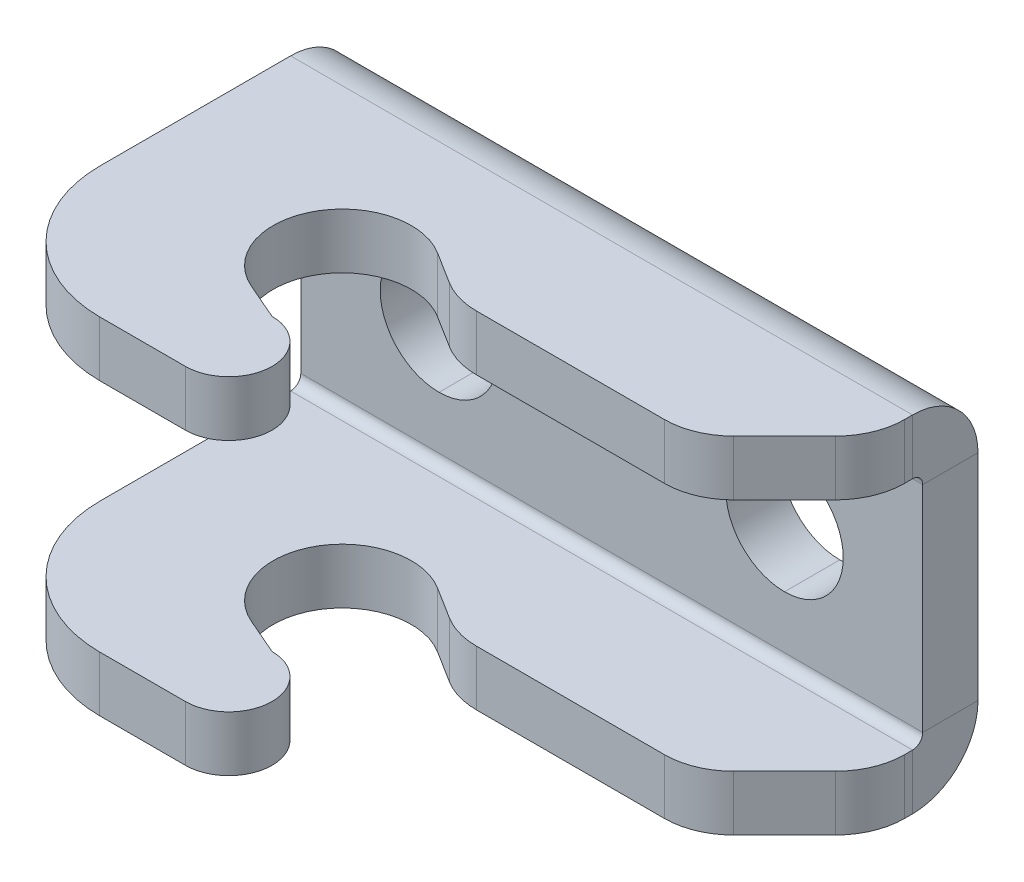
ISO-10303-21;
HEADER;
FILE_DESCRIPTION(('STEP AP214'),'2;1');
FILE_NAME('part.step','',(''),(''),'','','');
FILE_SCHEMA(('AUTOMOTIVE_DESIGN { 1 0 10303 214 1 1 1 1 }'));
ENDSEC;
DATA;
#1=APPLICATION_CONTEXT('core data for automotive mechanical design processes');
#2=APPLICATION_PROTOCOL_DEFINITION('international standard','automotive_design',2000,#1);
#3=PRODUCT_CONTEXT('',#1,'mechanical');
#4=PRODUCT('Part','Part','',(#3));
#5=PRODUCT_RELATED_PRODUCT_CATEGORY('part','',(#4));
#6=PRODUCT_DEFINITION_FORMATION('','',#4);
#7=PRODUCT_DEFINITION_CONTEXT('part definition',#1,'design');
#8=PRODUCT_DEFINITION('design','',#6,#7);
#9=PRODUCT_DEFINITION_SHAPE('','',#8);
#10=(LENGTH_UNIT() NAMED_UNIT(*) SI_UNIT(.MILLI.,.METRE.));
#11=(NAMED_UNIT(*) PLANE_ANGLE_UNIT() SI_UNIT($,.RADIAN.));
#12=(NAMED_UNIT(*) SI_UNIT($,.STERADIAN.) SOLID_ANGLE_UNIT());
#13=UNCERTAINTY_MEASURE_WITH_UNIT(LENGTH_MEASURE(1.E-05),#10,'distance_accuracy_value','');
#14=(GEOMETRIC_REPRESENTATION_CONTEXT(3) GLOBAL_UNCERTAINTY_ASSIGNED_CONTEXT((#13)) GLOBAL_UNIT_ASSIGNED_CONTEXT((#10,
#11,#12)) REPRESENTATION_CONTEXT('',''));
#15=CARTESIAN_POINT('',(0.,0.,0.));
#16=DIRECTION('',(0.,0.,1.));
#17=DIRECTION('',(1.,0.,0.));
#18=AXIS2_PLACEMENT_3D('',#15,#16,#17);
#19=CARTESIAN_POINT('',(25.,0.,0.));
#20=DIRECTION('',(0.,0.,1.));
#21=DIRECTION('',(0.,1.,0.));
#22=AXIS2_PLACEMENT_3D('',#19,#20,#21);
#23=CYLINDRICAL_SURFACE('',#22,4.25);
#24=CARTESIAN_POINT('',(25.,0.,0.));
#25=DIRECTION('',(0.,0.,1.));
#26=DIRECTION('',(0.,1.,0.));
#27=AXIS2_PLACEMENT_3D('',#24,#25,#26);
#28=CIRCLE('',#27,4.25);
#29=CARTESIAN_POINT('',(25.,-4.25,0.));
#30=VERTEX_POINT('',#29);
#31=CARTESIAN_POINT('',(25.,4.24999999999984,0.));
#32=VERTEX_POINT('',#31);
#33=EDGE_CURVE('E38',#30,#32,#28,.T.);
#34=ORIENTED_EDGE('',*,*,#33,.F.);
#35=DIRECTION('',(0.,0.,1.));
#36=VECTOR('',#35,1.);
#37=CARTESIAN_POINT('',(25.,-4.25,0.));
#38=LINE('',#37,#36);
#39=CARTESIAN_POINT('',(25.,-4.25,4.));
#40=VERTEX_POINT('',#39);
#41=EDGE_CURVE('E9',#30,#40,#38,.T.);
#42=ORIENTED_EDGE('',*,*,#41,.T.);
#43=CARTESIAN_POINT('',(25.,0.,4.));
#44=DIRECTION('',(0.,0.,1.));
#45=DIRECTION('',(0.,1.,0.));
#46=AXIS2_PLACEMENT_3D('',#43,#44,#45);
#47=CIRCLE('',#46,4.25);
#48=CARTESIAN_POINT('',(25.,4.24999999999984,4.));
#49=VERTEX_POINT('',#48);
#50=EDGE_CURVE('E24',#40,#49,#47,.T.);
#51=ORIENTED_EDGE('',*,*,#50,.T.);
#52=DIRECTION('',(0.,0.,1.));
#53=VECTOR('',#52,1.);
#54=CARTESIAN_POINT('',(25.,4.24999999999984,0.));
#55=LINE('',#54,#53);
#56=EDGE_CURVE('E560',#32,#49,#55,.T.);
#57=ORIENTED_EDGE('',*,*,#56,.F.);
#58=EDGE_LOOP('',(#34,#42,#51,#57));
#59=FACE_BOUND('',#58,.T.);
#60=ADVANCED_FACE('F14',(#59),#23,.F.);
#61=CARTESIAN_POINT('',(0.,0.,0.));
#62=DIRECTION('',(0.,0.,1.));
#63=DIRECTION('',(0.,1.,0.));
#64=AXIS2_PLACEMENT_3D('',#61,#62,#63);
#65=CYLINDRICAL_SURFACE('',#64,4.25);
#66=CARTESIAN_POINT('',(0.,0.,0.));
#67=DIRECTION('',(0.,0.,1.));
#68=DIRECTION('',(0.,1.,0.));
#69=AXIS2_PLACEMENT_3D('',#66,#67,#68);
#70=CIRCLE('',#69,4.25);
#71=CARTESIAN_POINT('',(0.,-4.25,0.));
#72=VERTEX_POINT('',#71);
#73=CARTESIAN_POINT('',(0.,4.24999999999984,0.));
#74=VERTEX_POINT('',#73);
#75=EDGE_CURVE('E366',#72,#74,#70,.T.);
#76=ORIENTED_EDGE('',*,*,#75,.F.);
#77=DIRECTION('',(0.,0.,1.));
#78=VECTOR('',#77,1.);
#79=CARTESIAN_POINT('',(0.,-4.25,0.));
#80=LINE('',#79,#78);
#81=CARTESIAN_POINT('',(0.,-4.25,4.));
#82=VERTEX_POINT('',#81);
#83=EDGE_CURVE('E569',#72,#82,#80,.T.);
#84=ORIENTED_EDGE('',*,*,#83,.T.);
#85=CARTESIAN_POINT('',(0.,0.,4.));
#86=DIRECTION('',(0.,0.,1.));
#87=DIRECTION('',(0.,1.,0.));
#88=AXIS2_PLACEMENT_3D('',#85,#86,#87);
#89=CIRCLE('',#88,4.25);
#90=CARTESIAN_POINT('',(0.,4.24999999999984,4.));
#91=VERTEX_POINT('',#90);
#92=EDGE_CURVE('E447',#82,#91,#89,.T.);
#93=ORIENTED_EDGE('',*,*,#92,.T.);
#94=DIRECTION('',(0.,0.,1.));
#95=VECTOR('',#94,1.);
#96=CARTESIAN_POINT('',(0.,4.24999999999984,0.));
#97=LINE('',#96,#95);
#98=EDGE_CURVE('E471',#74,#91,#97,.T.);
#99=ORIENTED_EDGE('',*,*,#98,.F.);
#100=EDGE_LOOP('',(#76,#84,#93,#99));
#101=FACE_BOUND('',#100,.T.);
#102=ADVANCED_FACE('F1313',(#101),#65,.F.);
#103=CARTESIAN_POINT('',(-10.,-8.80000000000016,18.5003547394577));
#104=DIRECTION('',(1.,0.,0.));
#105=DIRECTION('',(0.,-1.,0.));
#106=AXIS2_PLACEMENT_3D('',#103,#104,#105);
#107=PLANE('',#106);
#108=DIRECTION('',(0.,-1.,0.));
#109=VECTOR('',#108,1.);
#110=CARTESIAN_POINT('',(-10.,-8.80000000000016,4.7366));
#111=LINE('',#110,#109);
#112=CARTESIAN_POINT('',(-10.,-8.80000000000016,4.7366));
#113=VERTEX_POINT('',#112);
#114=CARTESIAN_POINT('',(-10.,-12.8000000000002,4.7366));
#115=VERTEX_POINT('',#114);
#116=EDGE_CURVE('E443',#113,#115,#111,.T.);
#117=ORIENTED_EDGE('',*,*,#116,.T.);
#118=DIRECTION('',(0.,0.,1.));
#119=VECTOR('',#118,1.);
#120=CARTESIAN_POINT('',(-10.,-12.8000000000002,18.5003547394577));
#121=LINE('',#120,#119);
#122=CARTESIAN_POINT('',(-10.,-12.8000000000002,18.5003547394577));
#123=VERTEX_POINT('',#122);
#124=EDGE_CURVE('E448',#115,#123,#121,.T.);
#125=ORIENTED_EDGE('',*,*,#124,.T.);
#126=DIRECTION('',(0.,-1.,0.));
#127=VECTOR('',#126,1.);
#128=CARTESIAN_POINT('',(-10.,-8.80000000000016,18.5003547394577));
#129=LINE('',#128,#127);
#130=CARTESIAN_POINT('',(-10.,-8.80000000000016,18.5003547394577));
#131=VERTEX_POINT('',#130);
#132=EDGE_CURVE('E337',#131,#123,#129,.T.);
#133=ORIENTED_EDGE('',*,*,#132,.F.);
#134=DIRECTION('',(0.,0.,1.));
#135=VECTOR('',#134,1.);
#136=CARTESIAN_POINT('',(-10.,-8.80000000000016,18.5003547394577));
#137=LINE('',#136,#135);
#138=EDGE_CURVE('E449',#113,#131,#137,.T.);
#139=ORIENTED_EDGE('',*,*,#138,.F.);
#140=EDGE_LOOP('',(#117,#125,#133,#139));
#141=FACE_BOUND('',#140,.T.);
#142=ADVANCED_FACE('F832',(#141),#107,.F.);
#143=CARTESIAN_POINT('',(35.,-8.80000000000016,5.31796021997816));
#144=DIRECTION('',(-1.,0.,0.));
#145=DIRECTION('',(0.,1.,0.));
#146=AXIS2_PLACEMENT_3D('',#143,#144,#145);
#147=PLANE('',#146);
#148=DIRECTION('',(0.,-1.,0.));
#149=VECTOR('',#148,1.);
#150=CARTESIAN_POINT('',(35.,-8.80000000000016,4.7366));
#151=LINE('',#150,#149);
#152=CARTESIAN_POINT('',(35.,-8.80000000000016,4.7366));
#153=VERTEX_POINT('',#152);
#154=CARTESIAN_POINT('',(35.,-12.8000000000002,4.7366));
#155=VERTEX_POINT('',#154);
#156=EDGE_CURVE('E512',#153,#155,#151,.T.);
#157=ORIENTED_EDGE('',*,*,#156,.F.);
#158=DIRECTION('',(0.,0.,-1.));
#159=VECTOR('',#158,1.);
#160=CARTESIAN_POINT('',(35.,-8.80000000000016,5.31796021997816));
#161=LINE('',#160,#159);
#162=CARTESIAN_POINT('',(35.,-8.80000000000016,5.31796021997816));
#163=VERTEX_POINT('',#162);
#164=EDGE_CURVE('E453',#163,#153,#161,.T.);
#165=ORIENTED_EDGE('',*,*,#164,.F.);
#166=DIRECTION('',(0.,-1.,0.));
#167=VECTOR('',#166,1.);
#168=CARTESIAN_POINT('',(35.,-8.80000000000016,5.31796021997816));
#169=LINE('',#168,#167);
#170=CARTESIAN_POINT('',(35.,-12.8000000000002,5.31796021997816));
#171=VERTEX_POINT('',#170);
#172=EDGE_CURVE('E461',#163,#171,#169,.T.);
#173=ORIENTED_EDGE('',*,*,#172,.T.);
#174=DIRECTION('',(0.,0.,-1.));
#175=VECTOR('',#174,1.);
#176=CARTESIAN_POINT('',(35.,-12.8000000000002,5.31796021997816));
#177=LINE('',#176,#175);
#178=EDGE_CURVE('E634',#171,#155,#177,.T.);
#179=ORIENTED_EDGE('',*,*,#178,.T.);
#180=EDGE_LOOP('',(#157,#165,#173,#179));
#181=FACE_BOUND('',#180,.T.);
#182=ADVANCED_FACE('F794',(#181),#147,.F.);
#183=CARTESIAN_POINT('',(30.,-8.80000000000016,5.31796021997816));
#184=DIRECTION('',(0.,1.,0.));
#185=DIRECTION('',(-1.,0.,0.));
#186=AXIS2_PLACEMENT_3D('',#183,#184,#185);
#187=PLANE('',#186);
#188=ORIENTED_EDGE('',*,*,#164,.T.);
#189=DIRECTION('',(1.,0.,0.));
#190=VECTOR('',#189,1.);
#191=CARTESIAN_POINT('',(-10.,-8.80000000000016,4.7366));
#192=LINE('',#191,#190);
#193=EDGE_CURVE('E556',#113,#153,#192,.T.);
#194=ORIENTED_EDGE('',*,*,#193,.F.);
#195=ORIENTED_EDGE('',*,*,#138,.T.);
#196=CARTESIAN_POINT('',(-0.500000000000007,-8.80000000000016,18.5003547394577));
#197=DIRECTION('',(0.,1.,0.));
#198=DIRECTION('',(0.,0.,-1.));
#199=AXIS2_PLACEMENT_3D('',#196,#197,#198);
#200=CIRCLE('',#199,9.5);
#201=CARTESIAN_POINT('',(-0.582097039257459,-8.80000000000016,28.));
#202=VERTEX_POINT('',#201);
#203=EDGE_CURVE('E431',#131,#202,#200,.T.);
#204=ORIENTED_EDGE('',*,*,#203,.T.);
#205=DIRECTION('',(1.,0.,0.));
#206=VECTOR('',#205,1.);
#207=CARTESIAN_POINT('',(5.65426838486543,-8.80000000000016,28.));
#208=LINE('',#207,#206);
#209=CARTESIAN_POINT('',(5.65426838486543,-8.80000000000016,28.));
#210=VERTEX_POINT('',#209);
#211=EDGE_CURVE('E427',#202,#210,#208,.T.);
#212=ORIENTED_EDGE('',*,*,#211,.T.);
#213=CARTESIAN_POINT('',(5.65426838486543,-8.80000000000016,24.8666125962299));
#214=DIRECTION('',(0.,1.,0.));
#215=DIRECTION('',(0.,0.,-1.));
#216=AXIS2_PLACEMENT_3D('',#213,#214,#215);
#217=CIRCLE('',#216,3.1333874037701);
#218=CARTESIAN_POINT('',(5.65426838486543,-8.80000000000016,21.7332251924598));
#219=VERTEX_POINT('',#218);
#220=EDGE_CURVE('E432',#210,#219,#217,.T.);
#221=ORIENTED_EDGE('',*,*,#220,.T.);
#222=DIRECTION('',(-0.91749887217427,0.,-0.397738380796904));
#223=VECTOR('',#222,1.);
#224=CARTESIAN_POINT('',(5.65426838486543,-8.80000000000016,21.7332251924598));
#225=LINE('',#224,#223);
#226=CARTESIAN_POINT('',(3.01130809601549,-8.80000000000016,20.5874943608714));
#227=VERTEX_POINT('',#226);
#228=EDGE_CURVE('E392',#219,#227,#225,.T.);
#229=ORIENTED_EDGE('',*,*,#228,.T.);
#230=CARTESIAN_POINT('',(5.,-8.80000000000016,16.));
#231=DIRECTION('',(0.,-1.,0.));
#232=DIRECTION('',(0.,0.,-1.));
#233=AXIS2_PLACEMENT_3D('',#230,#231,#232);
#234=CIRCLE('',#233,5.);
#235=CARTESIAN_POINT('',(7.65685980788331,-8.80000000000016,11.7643069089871));
#236=VERTEX_POINT('',#235);
#237=EDGE_CURVE('E388',#227,#236,#234,.T.);
#238=ORIENTED_EDGE('',*,*,#237,.T.);
#239=DIRECTION('',(0.847138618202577,0.,0.531371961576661));
#240=VECTOR('',#239,1.);
#241=CARTESIAN_POINT('',(7.65685980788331,-8.80000000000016,11.7643069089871));
#242=LINE('',#241,#240);
#243=CARTESIAN_POINT('',(9.96454832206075,-8.80000000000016,13.2118161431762));
#244=VERTEX_POINT('',#243);
#245=EDGE_CURVE('E393',#236,#244,#242,.T.);
#246=ORIENTED_EDGE('',*,*,#245,.T.);
#247=CARTESIAN_POINT('',(12.7044084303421,-8.80000000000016,8.84380000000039));
#248=DIRECTION('',(0.,1.,0.));
#249=DIRECTION('',(0.,0.,-1.));
#250=AXIS2_PLACEMENT_3D('',#247,#248,#249);
#251=CIRCLE('',#250,5.15619999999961);
#252=CARTESIAN_POINT('',(12.7044084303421,-8.80000000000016,14.));
#253=VERTEX_POINT('',#252);
#254=EDGE_CURVE('E484',#244,#253,#251,.T.);
#255=ORIENTED_EDGE('',*,*,#254,.T.);
#256=DIRECTION('',(1.,0.,0.));
#257=VECTOR('',#256,1.);
#258=CARTESIAN_POINT('',(12.7044084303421,-8.80000000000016,14.));
#259=LINE('',#258,#257);
#260=CARTESIAN_POINT('',(26.3179602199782,-8.80000000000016,14.));
#261=VERTEX_POINT('',#260);
#262=EDGE_CURVE('E638',#253,#261,#259,.T.);
#263=ORIENTED_EDGE('',*,*,#262,.T.);
#264=CARTESIAN_POINT('',(26.3179602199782,-8.80000000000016,9.));
#265=DIRECTION('',(0.,1.,0.));
#266=DIRECTION('',(0.,0.,-1.));
#267=AXIS2_PLACEMENT_3D('',#264,#265,#266);
#268=CIRCLE('',#267,5.);
#269=CARTESIAN_POINT('',(29.8534941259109,-8.80000000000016,12.5355339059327));
#270=VERTEX_POINT('',#269);
#271=EDGE_CURVE('E642',#261,#270,#268,.T.);
#272=ORIENTED_EDGE('',*,*,#271,.T.);
#273=DIRECTION('',(0.707106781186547,0.,-0.707106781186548));
#274=VECTOR('',#273,1.);
#275=CARTESIAN_POINT('',(33.5355339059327,-8.80000000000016,8.85349412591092));
#276=LINE('',#275,#274);
#277=CARTESIAN_POINT('',(33.5355339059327,-8.80000000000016,8.85349412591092));
#278=VERTEX_POINT('',#277);
#279=EDGE_CURVE('E537',#270,#278,#276,.T.);
#280=ORIENTED_EDGE('',*,*,#279,.T.);
#281=CARTESIAN_POINT('',(30.,-8.80000000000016,5.31796021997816));
#282=DIRECTION('',(0.,1.,0.));
#283=DIRECTION('',(0.,0.,-1.));
#284=AXIS2_PLACEMENT_3D('',#281,#282,#283);
#285=CIRCLE('',#284,5.);
#286=EDGE_CURVE('E436',#278,#163,#285,.T.);
#287=ORIENTED_EDGE('',*,*,#286,.T.);
#288=EDGE_LOOP('',(#188,#194,#195,#204,#212,#221,#229,#238,#246,#255,#263,#272,#280,#287));
#289=FACE_BOUND('',#288,.T.);
#290=ADVANCED_FACE('F797',(#289),#187,.T.);
#291=CARTESIAN_POINT('',(30.,-12.8000000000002,5.31796021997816));
#292=DIRECTION('',(0.,1.,0.));
#293=DIRECTION('',(-1.,0.,0.));
#294=AXIS2_PLACEMENT_3D('',#291,#292,#293);
#295=PLANE('',#294);
#296=DIRECTION('',(1.,0.,0.));
#297=VECTOR('',#296,1.);
#298=CARTESIAN_POINT('',(-10.,-12.8000000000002,4.7366));
#299=LINE('',#298,#297);
#300=EDGE_CURVE('E336',#115,#155,#299,.T.);
#301=ORIENTED_EDGE('',*,*,#300,.T.);
#302=ORIENTED_EDGE('',*,*,#178,.F.);
#303=CARTESIAN_POINT('',(30.,-12.8000000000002,5.31796021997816));
#304=DIRECTION('',(0.,1.,0.));
#305=DIRECTION('',(0.,0.,-1.));
#306=AXIS2_PLACEMENT_3D('',#303,#304,#305);
#307=CIRCLE('',#306,5.);
#308=CARTESIAN_POINT('',(33.5355339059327,-12.8000000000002,8.85349412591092));
#309=VERTEX_POINT('',#308);
#310=EDGE_CURVE('E359',#309,#171,#307,.T.);
#311=ORIENTED_EDGE('',*,*,#310,.F.);
#312=DIRECTION('',(0.707106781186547,0.,-0.707106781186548));
#313=VECTOR('',#312,1.);
#314=CARTESIAN_POINT('',(33.5355339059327,-12.8000000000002,8.85349412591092));
#315=LINE('',#314,#313);
#316=CARTESIAN_POINT('',(29.8534941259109,-12.8000000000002,12.5355339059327));
#317=VERTEX_POINT('',#316);
#318=EDGE_CURVE('E358',#317,#309,#315,.T.);
#319=ORIENTED_EDGE('',*,*,#318,.F.);
#320=CARTESIAN_POINT('',(26.3179602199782,-12.8000000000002,9.));
#321=DIRECTION('',(0.,1.,0.));
#322=DIRECTION('',(0.,0.,-1.));
#323=AXIS2_PLACEMENT_3D('',#320,#321,#322);
#324=CIRCLE('',#323,5.);
#325=CARTESIAN_POINT('',(26.3179602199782,-12.8000000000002,14.));
#326=VERTEX_POINT('',#325);
#327=EDGE_CURVE('E408',#326,#317,#324,.T.);
#328=ORIENTED_EDGE('',*,*,#327,.F.);
#329=DIRECTION('',(1.,0.,0.));
#330=VECTOR('',#329,1.);
#331=CARTESIAN_POINT('',(12.7044084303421,-12.8000000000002,14.));
#332=LINE('',#331,#330);
#333=CARTESIAN_POINT('',(12.7044084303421,-12.8000000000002,14.));
#334=VERTEX_POINT('',#333);
#335=EDGE_CURVE('E495',#334,#326,#332,.T.);
#336=ORIENTED_EDGE('',*,*,#335,.F.);
#337=CARTESIAN_POINT('',(12.7044084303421,-12.8000000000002,8.84380000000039));
#338=DIRECTION('',(0.,1.,0.));
#339=DIRECTION('',(0.,0.,-1.));
#340=AXIS2_PLACEMENT_3D('',#337,#338,#339);
#341=CIRCLE('',#340,5.15619999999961);
#342=CARTESIAN_POINT('',(9.96454832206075,-12.8000000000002,13.2118161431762));
#343=VERTEX_POINT('',#342);
#344=EDGE_CURVE('E349',#343,#334,#341,.T.);
#345=ORIENTED_EDGE('',*,*,#344,.F.);
#346=DIRECTION('',(0.847138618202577,0.,0.531371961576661));
#347=VECTOR('',#346,1.);
#348=CARTESIAN_POINT('',(7.65685980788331,-12.8000000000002,11.7643069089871));
#349=LINE('',#348,#347);
#350=CARTESIAN_POINT('',(7.65685980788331,-12.8000000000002,11.7643069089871));
#351=VERTEX_POINT('',#350);
#352=EDGE_CURVE('E348',#351,#343,#349,.T.);
#353=ORIENTED_EDGE('',*,*,#352,.F.);
#354=CARTESIAN_POINT('',(5.,-12.8000000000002,16.));
#355=DIRECTION('',(0.,-1.,0.));
#356=DIRECTION('',(0.,0.,-1.));
#357=AXIS2_PLACEMENT_3D('',#354,#355,#356);
#358=CIRCLE('',#357,5.);
#359=CARTESIAN_POINT('',(3.01130809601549,-12.8000000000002,20.5874943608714));
#360=VERTEX_POINT('',#359);
#361=EDGE_CURVE('E376',#360,#351,#358,.T.);
#362=ORIENTED_EDGE('',*,*,#361,.F.);
#363=DIRECTION('',(-0.91749887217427,0.,-0.397738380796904));
#364=VECTOR('',#363,1.);
#365=CARTESIAN_POINT('',(5.65426838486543,-12.8000000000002,21.7332251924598));
#366=LINE('',#365,#364);
#367=CARTESIAN_POINT('',(5.65426838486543,-12.8000000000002,21.7332251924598));
#368=VERTEX_POINT('',#367);
#369=EDGE_CURVE('E521',#368,#360,#366,.T.);
#370=ORIENTED_EDGE('',*,*,#369,.F.);
#371=CARTESIAN_POINT('',(5.65426838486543,-12.8000000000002,24.8666125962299));
#372=DIRECTION('',(0.,1.,0.));
#373=DIRECTION('',(0.,0.,-1.));
#374=AXIS2_PLACEMENT_3D('',#371,#372,#373);
#375=CIRCLE('',#374,3.1333874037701);
#376=CARTESIAN_POINT('',(5.65426838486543,-12.8000000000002,28.));
#377=VERTEX_POINT('',#376);
#378=EDGE_CURVE('E317',#377,#368,#375,.T.);
#379=ORIENTED_EDGE('',*,*,#378,.F.);
#380=DIRECTION('',(1.,0.,0.));
#381=VECTOR('',#380,1.);
#382=CARTESIAN_POINT('',(5.65426838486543,-12.8000000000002,28.));
#383=LINE('',#382,#381);
#384=CARTESIAN_POINT('',(-0.582097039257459,-12.8000000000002,28.));
#385=VERTEX_POINT('',#384);
#386=EDGE_CURVE('E400',#385,#377,#383,.T.);
#387=ORIENTED_EDGE('',*,*,#386,.F.);
#388=CARTESIAN_POINT('',(-0.500000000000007,-12.8000000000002,18.5003547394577));
#389=DIRECTION('',(0.,1.,0.));
#390=DIRECTION('',(0.,0.,-1.));
#391=AXIS2_PLACEMENT_3D('',#388,#389,#390);
#392=CIRCLE('',#391,9.5);
#393=EDGE_CURVE('E332',#123,#385,#392,.T.);
#394=ORIENTED_EDGE('',*,*,#393,.F.);
#395=ORIENTED_EDGE('',*,*,#124,.F.);
#396=EDGE_LOOP('',(#301,#302,#311,#319,#328,#336,#345,#353,#362,#370,#379,#387,#394,#395));
#397=FACE_BOUND('',#396,.T.);
#398=ADVANCED_FACE('F713',(#397),#295,.F.);
#399=CARTESIAN_POINT('',(-0.500000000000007,-8.80000000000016,18.5003547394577));
#400=DIRECTION('',(0.,-1.,0.));
#401=DIRECTION('',(0.,0.,1.));
#402=AXIS2_PLACEMENT_3D('',#399,#400,#401);
#403=CYLINDRICAL_SURFACE('',#402,9.5);
#404=ORIENTED_EDGE('',*,*,#393,.T.);
#405=DIRECTION('',(0.,-1.,0.));
#406=VECTOR('',#405,1.);
#407=CARTESIAN_POINT('',(-0.582097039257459,-8.80000000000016,28.));
#408=LINE('',#407,#406);
#409=EDGE_CURVE('E320',#202,#385,#408,.T.);
#410=ORIENTED_EDGE('',*,*,#409,.F.);
#411=ORIENTED_EDGE('',*,*,#203,.F.);
#412=ORIENTED_EDGE('',*,*,#132,.T.);
#413=EDGE_LOOP('',(#404,#410,#411,#412));
#414=FACE_BOUND('',#413,.T.);
#415=ADVANCED_FACE('F836',(#414),#403,.T.);
#416=CARTESIAN_POINT('',(5.65426838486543,-8.80000000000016,28.));
#417=DIRECTION('',(0.,0.,-1.));
#418=DIRECTION('',(0.,-1.,0.));
#419=AXIS2_PLACEMENT_3D('',#416,#417,#418);
#420=PLANE('',#419);
#421=ORIENTED_EDGE('',*,*,#386,.T.);
#422=DIRECTION('',(0.,-1.,0.));
#423=VECTOR('',#422,1.);
#424=CARTESIAN_POINT('',(5.65426838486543,-8.80000000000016,28.));
#425=LINE('',#424,#423);
#426=EDGE_CURVE('E321',#210,#377,#425,.T.);
#427=ORIENTED_EDGE('',*,*,#426,.F.);
#428=ORIENTED_EDGE('',*,*,#211,.F.);
#429=ORIENTED_EDGE('',*,*,#409,.T.);
#430=EDGE_LOOP('',(#421,#427,#428,#429));
#431=FACE_BOUND('',#430,.T.);
#432=ADVANCED_FACE('F1038',(#431),#420,.F.);
#433=CARTESIAN_POINT('',(5.65426838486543,-8.80000000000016,24.8666125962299));
#434=DIRECTION('',(0.,-1.,0.));
#435=DIRECTION('',(0.,0.,1.));
#436=AXIS2_PLACEMENT_3D('',#433,#434,#435);
#437=CYLINDRICAL_SURFACE('',#436,3.1333874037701);
#438=ORIENTED_EDGE('',*,*,#378,.T.);
#439=DIRECTION('',(0.,-1.,0.));
#440=VECTOR('',#439,1.);
#441=CARTESIAN_POINT('',(5.65426838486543,-8.80000000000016,21.7332251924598));
#442=LINE('',#441,#440);
#443=EDGE_CURVE('E525',#219,#368,#442,.T.);
#444=ORIENTED_EDGE('',*,*,#443,.F.);
#445=ORIENTED_EDGE('',*,*,#220,.F.);
#446=ORIENTED_EDGE('',*,*,#426,.T.);
#447=EDGE_LOOP('',(#438,#444,#445,#446));
#448=FACE_BOUND('',#447,.T.);
#449=ADVANCED_FACE('F1032',(#448),#437,.T.);
#450=CARTESIAN_POINT('',(5.65426838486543,-8.80000000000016,21.7332251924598));
#451=DIRECTION('',(-0.397738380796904,0.,0.91749887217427));
#452=DIRECTION('',(0.,1.,0.));
#453=AXIS2_PLACEMENT_3D('',#450,#451,#452);
#454=PLANE('',#453);
#455=ORIENTED_EDGE('',*,*,#369,.T.);
#456=DIRECTION('',(0.,-1.,0.));
#457=VECTOR('',#456,1.);
#458=CARTESIAN_POINT('',(3.01130809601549,-8.80000000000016,20.5874943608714));
#459=LINE('',#458,#457);
#460=EDGE_CURVE('E372',#227,#360,#459,.T.);
#461=ORIENTED_EDGE('',*,*,#460,.F.);
#462=ORIENTED_EDGE('',*,*,#228,.F.);
#463=ORIENTED_EDGE('',*,*,#443,.T.);
#464=EDGE_LOOP('',(#455,#461,#462,#463));
#465=FACE_BOUND('',#464,.T.);
#466=ADVANCED_FACE('F1037',(#465),#454,.F.);
#467=CARTESIAN_POINT('',(5.,-8.80000000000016,16.));
#468=DIRECTION('',(0.,-1.,0.));
#469=DIRECTION('',(0.,0.,1.));
#470=AXIS2_PLACEMENT_3D('',#467,#468,#469);
#471=CYLINDRICAL_SURFACE('',#470,5.);
#472=ORIENTED_EDGE('',*,*,#361,.T.);
#473=DIRECTION('',(0.,-1.,0.));
#474=VECTOR('',#473,1.);
#475=CARTESIAN_POINT('',(7.65685980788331,-8.80000000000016,11.7643069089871));
#476=LINE('',#475,#474);
#477=EDGE_CURVE('E344',#236,#351,#476,.T.);
#478=ORIENTED_EDGE('',*,*,#477,.F.);
#479=ORIENTED_EDGE('',*,*,#237,.F.);
#480=ORIENTED_EDGE('',*,*,#460,.T.);
#481=EDGE_LOOP('',(#472,#478,#479,#480));
#482=FACE_BOUND('',#481,.T.);
#483=ADVANCED_FACE('F1053',(#482),#471,.F.);
#484=CARTESIAN_POINT('',(7.65685980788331,-8.80000000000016,11.7643069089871));
#485=DIRECTION('',(0.531371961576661,0.,-0.847138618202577));
#486=DIRECTION('',(0.847138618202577,0.,0.531371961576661));
#487=AXIS2_PLACEMENT_3D('',#484,#485,#486);
#488=PLANE('',#487);
#489=ORIENTED_EDGE('',*,*,#352,.T.);
#490=DIRECTION('',(0.,-1.,0.));
#491=VECTOR('',#490,1.);
#492=CARTESIAN_POINT('',(9.96454832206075,-8.80000000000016,13.2118161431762));
#493=LINE('',#492,#491);
#494=EDGE_CURVE('E465',#244,#343,#493,.T.);
#495=ORIENTED_EDGE('',*,*,#494,.F.);
#496=ORIENTED_EDGE('',*,*,#245,.F.);
#497=ORIENTED_EDGE('',*,*,#477,.T.);
#498=EDGE_LOOP('',(#489,#495,#496,#497));
#499=FACE_BOUND('',#498,.T.);
#500=ADVANCED_FACE('F1047',(#499),#488,.F.);
#501=CARTESIAN_POINT('',(12.7044084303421,-8.80000000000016,8.84380000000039));
#502=DIRECTION('',(0.,-1.,0.));
#503=DIRECTION('',(0.,0.,1.));
#504=AXIS2_PLACEMENT_3D('',#501,#502,#503);
#505=CYLINDRICAL_SURFACE('',#504,5.15619999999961);
#506=ORIENTED_EDGE('',*,*,#344,.T.);
#507=DIRECTION('',(0.,-1.,0.));
#508=VECTOR('',#507,1.);
#509=CARTESIAN_POINT('',(12.7044084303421,-8.80000000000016,14.));
#510=LINE('',#509,#508);
#511=EDGE_CURVE('E520',#253,#334,#510,.T.);
#512=ORIENTED_EDGE('',*,*,#511,.F.);
#513=ORIENTED_EDGE('',*,*,#254,.F.);
#514=ORIENTED_EDGE('',*,*,#494,.T.);
#515=EDGE_LOOP('',(#506,#512,#513,#514));
#516=FACE_BOUND('',#515,.T.);
#517=ADVANCED_FACE('F1052',(#516),#505,.T.);
#518=CARTESIAN_POINT('',(12.7044084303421,-8.80000000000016,14.));
#519=DIRECTION('',(0.,0.,-1.));
#520=DIRECTION('',(0.,-1.,0.));
#521=AXIS2_PLACEMENT_3D('',#518,#519,#520);
#522=PLANE('',#521);
#523=ORIENTED_EDGE('',*,*,#335,.T.);
#524=DIRECTION('',(0.,-1.,0.));
#525=VECTOR('',#524,1.);
#526=CARTESIAN_POINT('',(26.3179602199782,-8.80000000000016,14.));
#527=LINE('',#526,#525);
#528=EDGE_CURVE('E404',#261,#326,#527,.T.);
#529=ORIENTED_EDGE('',*,*,#528,.F.);
#530=ORIENTED_EDGE('',*,*,#262,.F.);
#531=ORIENTED_EDGE('',*,*,#511,.T.);
#532=EDGE_LOOP('',(#523,#529,#530,#531));
#533=FACE_BOUND('',#532,.T.);
#534=ADVANCED_FACE('F723',(#533),#522,.F.);
#535=CARTESIAN_POINT('',(26.3179602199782,-8.80000000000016,9.));
#536=DIRECTION('',(0.,-1.,0.));
#537=DIRECTION('',(0.,0.,1.));
#538=AXIS2_PLACEMENT_3D('',#535,#536,#537);
#539=CYLINDRICAL_SURFACE('',#538,5.);
#540=ORIENTED_EDGE('',*,*,#327,.T.);
#541=DIRECTION('',(0.,-1.,0.));
#542=VECTOR('',#541,1.);
#543=CARTESIAN_POINT('',(29.8534941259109,-8.80000000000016,12.5355339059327));
#544=LINE('',#543,#542);
#545=EDGE_CURVE('E354',#270,#317,#544,.T.);
#546=ORIENTED_EDGE('',*,*,#545,.F.);
#547=ORIENTED_EDGE('',*,*,#271,.F.);
#548=ORIENTED_EDGE('',*,*,#528,.T.);
#549=EDGE_LOOP('',(#540,#546,#547,#548));
#550=FACE_BOUND('',#549,.T.);
#551=ADVANCED_FACE('F719',(#550),#539,.T.);
#552=CARTESIAN_POINT('',(33.5355339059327,-8.80000000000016,8.85349412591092));
#553=DIRECTION('',(-0.707106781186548,0.,-0.707106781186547));
#554=DIRECTION('',(0.,-1.,0.));
#555=AXIS2_PLACEMENT_3D('',#552,#553,#554);
#556=PLANE('',#555);
#557=ORIENTED_EDGE('',*,*,#318,.T.);
#558=DIRECTION('',(0.,-1.,0.));
#559=VECTOR('',#558,1.);
#560=CARTESIAN_POINT('',(33.5355339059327,-8.80000000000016,8.85349412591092));
#561=LINE('',#560,#559);
#562=EDGE_CURVE('E491',#278,#309,#561,.T.);
#563=ORIENTED_EDGE('',*,*,#562,.F.);
#564=ORIENTED_EDGE('',*,*,#279,.F.);
#565=ORIENTED_EDGE('',*,*,#545,.T.);
#566=EDGE_LOOP('',(#557,#563,#564,#565));
#567=FACE_BOUND('',#566,.T.);
#568=ADVANCED_FACE('F708',(#567),#556,.F.);
#569=CARTESIAN_POINT('',(30.,-8.80000000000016,5.31796021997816));
#570=DIRECTION('',(0.,-1.,0.));
#571=DIRECTION('',(0.,0.,1.));
#572=AXIS2_PLACEMENT_3D('',#569,#570,#571);
#573=CYLINDRICAL_SURFACE('',#572,5.);
#574=ORIENTED_EDGE('',*,*,#310,.T.);
#575=ORIENTED_EDGE('',*,*,#172,.F.);
#576=ORIENTED_EDGE('',*,*,#286,.F.);
#577=ORIENTED_EDGE('',*,*,#562,.T.);
#578=EDGE_LOOP('',(#574,#575,#576,#577));
#579=FACE_BOUND('',#578,.T.);
#580=ADVANCED_FACE('F704',(#579),#573,.T.);
#581=CARTESIAN_POINT('',(35.,-8.06340000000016,4.7366));
#582=DIRECTION('',(1.,0.,0.));
#583=DIRECTION('',(0.,0.,-1.));
#584=AXIS2_PLACEMENT_3D('',#581,#582,#583);
#585=PLANE('',#584);
#586=DIRECTION('',(0.,0.,-1.));
#587=VECTOR('',#586,1.);
#588=CARTESIAN_POINT('',(35.,-8.06340000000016,0.));
#589=LINE('',#588,#587);
#590=CARTESIAN_POINT('',(35.,-8.06340000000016,4.));
#591=VERTEX_POINT('',#590);
#592=CARTESIAN_POINT('',(35.,-8.06340000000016,0.));
#593=VERTEX_POINT('',#592);
#594=EDGE_CURVE('E508',#591,#593,#589,.T.);
#595=ORIENTED_EDGE('',*,*,#594,.F.);
#596=CARTESIAN_POINT('',(35.,-8.06340000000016,4.7366));
#597=DIRECTION('',(1.,0.,0.));
#598=DIRECTION('',(0.,0.,1.));
#599=AXIS2_PLACEMENT_3D('',#596,#597,#598);
#600=CIRCLE('',#599,0.7366);
#601=EDGE_CURVE('E578',#153,#591,#600,.T.);
#602=ORIENTED_EDGE('',*,*,#601,.F.);
#603=ORIENTED_EDGE('',*,*,#156,.T.);
#604=CARTESIAN_POINT('',(35.,-8.06340000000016,4.7366));
#605=DIRECTION('',(1.,0.,0.));
#606=DIRECTION('',(0.,0.,1.));
#607=AXIS2_PLACEMENT_3D('',#604,#605,#606);
#608=CIRCLE('',#607,4.7366);
#609=EDGE_CURVE('E398',#155,#593,#608,.T.);
#610=ORIENTED_EDGE('',*,*,#609,.T.);
#611=EDGE_LOOP('',(#595,#602,#603,#610));
#612=FACE_BOUND('',#611,.T.);
#613=ADVANCED_FACE('F798',(#612),#585,.T.);
#614=CARTESIAN_POINT('',(-10.,-8.06340000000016,4.7366));
#615=DIRECTION('',(1.,0.,0.));
#616=DIRECTION('',(0.,0.,-1.));
#617=AXIS2_PLACEMENT_3D('',#614,#615,#616);
#618=PLANE('',#617);
#619=CARTESIAN_POINT('',(-10.,-8.06340000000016,4.7366));
#620=DIRECTION('',(-1.,0.,0.));
#621=DIRECTION('',(0.,0.,1.));
#622=AXIS2_PLACEMENT_3D('',#619,#620,#621);
#623=CIRCLE('',#622,0.7366);
#624=CARTESIAN_POINT('',(-10.,-8.06340000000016,4.));
#625=VERTEX_POINT('',#624);
#626=EDGE_CURVE('E441',#625,#113,#623,.T.);
#627=ORIENTED_EDGE('',*,*,#626,.F.);
#628=DIRECTION('',(0.,0.,-1.));
#629=VECTOR('',#628,1.);
#630=CARTESIAN_POINT('',(-10.,-8.06340000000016,4.));
#631=LINE('',#630,#629);
#632=CARTESIAN_POINT('',(-10.,-8.06340000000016,0.));
#633=VERTEX_POINT('',#632);
#634=EDGE_CURVE('E394',#625,#633,#631,.T.);
#635=ORIENTED_EDGE('',*,*,#634,.T.);
#636=CARTESIAN_POINT('',(-10.,-8.06340000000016,4.7366));
#637=DIRECTION('',(-1.,0.,0.));
#638=DIRECTION('',(0.,0.,1.));
#639=AXIS2_PLACEMENT_3D('',#636,#637,#638);
#640=CIRCLE('',#639,4.7366);
#641=EDGE_CURVE('E399',#633,#115,#640,.T.);
#642=ORIENTED_EDGE('',*,*,#641,.T.);
#643=ORIENTED_EDGE('',*,*,#116,.F.);
#644=EDGE_LOOP('',(#627,#635,#642,#643));
#645=FACE_BOUND('',#644,.T.);
#646=ADVANCED_FACE('F786',(#645),#618,.F.);
#647=CARTESIAN_POINT('',(-10.,-8.06340000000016,4.7366));
#648=DIRECTION('',(-1.,0.,0.));
#649=DIRECTION('',(0.,0.,-1.));
#650=AXIS2_PLACEMENT_3D('',#647,#648,#649);
#651=CYLINDRICAL_SURFACE('',#650,4.7366);
#652=ORIENTED_EDGE('',*,*,#300,.F.);
#653=ORIENTED_EDGE('',*,*,#641,.F.);
#654=DIRECTION('',(1.,0.,0.));
#655=VECTOR('',#654,1.);
#656=CARTESIAN_POINT('',(35.,-8.06340000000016,0.));
#657=LINE('',#656,#655);
#658=EDGE_CURVE('E552',#633,#593,#657,.T.);
#659=ORIENTED_EDGE('',*,*,#658,.T.);
#660=ORIENTED_EDGE('',*,*,#609,.F.);
#661=EDGE_LOOP('',(#652,#653,#659,#660));
#662=FACE_BOUND('',#661,.T.);
#663=ADVANCED_FACE('F828',(#662),#651,.T.);
#664=CARTESIAN_POINT('',(-10.,-8.06340000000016,4.7366));
#665=DIRECTION('',(-1.,0.,0.));
#666=DIRECTION('',(0.,0.,-1.));
#667=AXIS2_PLACEMENT_3D('',#664,#665,#666);
#668=CYLINDRICAL_SURFACE('',#667,0.7366);
#669=ORIENTED_EDGE('',*,*,#193,.T.);
#670=ORIENTED_EDGE('',*,*,#601,.T.);
#671=DIRECTION('',(-1.,0.,0.));
#672=VECTOR('',#671,1.);
#673=CARTESIAN_POINT('',(35.,-8.06340000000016,4.));
#674=LINE('',#673,#672);
#675=EDGE_CURVE('E595',#591,#625,#674,.T.);
#676=ORIENTED_EDGE('',*,*,#675,.T.);
#677=ORIENTED_EDGE('',*,*,#626,.T.);
#678=EDGE_LOOP('',(#669,#670,#676,#677));
#679=FACE_BOUND('',#678,.T.);
#680=ADVANCED_FACE('F788',(#679),#668,.F.);
#681=CARTESIAN_POINT('',(-10.,-0.300000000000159,0.));
#682=DIRECTION('',(1.,0.,0.));
#683=DIRECTION('',(0.,0.,-1.));
#684=AXIS2_PLACEMENT_3D('',#681,#682,#683);
#685=PLANE('',#684);
#686=ORIENTED_EDGE('',*,*,#634,.F.);
#687=DIRECTION('',(0.,1.,0.));
#688=VECTOR('',#687,1.);
#689=CARTESIAN_POINT('',(-10.,-0.300000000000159,4.));
#690=LINE('',#689,#688);
#691=CARTESIAN_POINT('',(-10.,7.46339999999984,3.99999999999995));
#692=VERTEX_POINT('',#691);
#693=EDGE_CURVE('E437',#625,#692,#690,.T.);
#694=ORIENTED_EDGE('',*,*,#693,.T.);
#695=DIRECTION('',(0.,0.,-1.));
#696=VECTOR('',#695,1.);
#697=CARTESIAN_POINT('',(-10.,7.46339999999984,3.99999999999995));
#698=LINE('',#697,#696);
#699=CARTESIAN_POINT('',(-10.,7.46339999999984,0.));
#700=VERTEX_POINT('',#699);
#701=EDGE_CURVE('E442',#692,#700,#698,.T.);
#702=ORIENTED_EDGE('',*,*,#701,.T.);
#703=DIRECTION('',(0.,1.,0.));
#704=VECTOR('',#703,1.);
#705=CARTESIAN_POINT('',(-10.,-8.80000000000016,0.));
#706=LINE('',#705,#704);
#707=EDGE_CURVE('E422',#633,#700,#706,.T.);
#708=ORIENTED_EDGE('',*,*,#707,.F.);
#709=EDGE_LOOP('',(#686,#694,#702,#708));
#710=FACE_BOUND('',#709,.T.);
#711=ADVANCED_FACE('F809',(#710),#685,.F.);
#712=CARTESIAN_POINT('',(35.,-8.80000000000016,0.));
#713=DIRECTION('',(-1.,0.,0.));
#714=DIRECTION('',(0.,1.,0.));
#715=AXIS2_PLACEMENT_3D('',#712,#713,#714);
#716=PLANE('',#715);
#717=ORIENTED_EDGE('',*,*,#594,.T.);
#718=DIRECTION('',(0.,-1.,0.));
#719=VECTOR('',#718,1.);
#720=CARTESIAN_POINT('',(35.,-8.80000000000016,0.));
#721=LINE('',#720,#719);
#722=CARTESIAN_POINT('',(35.,7.46339999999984,0.));
#723=VERTEX_POINT('',#722);
#724=EDGE_CURVE('E338',#723,#593,#721,.T.);
#725=ORIENTED_EDGE('',*,*,#724,.F.);
#726=DIRECTION('',(0.,0.,-1.));
#727=VECTOR('',#726,1.);
#728=CARTESIAN_POINT('',(35.,7.46339999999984,0.));
#729=LINE('',#728,#727);
#730=CARTESIAN_POINT('',(35.,7.46339999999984,4.));
#731=VERTEX_POINT('',#730);
#732=EDGE_CURVE('E579',#731,#723,#729,.T.);
#733=ORIENTED_EDGE('',*,*,#732,.F.);
#734=DIRECTION('',(0.,-1.,0.));
#735=VECTOR('',#734,1.);
#736=CARTESIAN_POINT('',(35.,-8.80000000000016,4.));
#737=LINE('',#736,#735);
#738=EDGE_CURVE('E425',#731,#591,#737,.T.);
#739=ORIENTED_EDGE('',*,*,#738,.T.);
#740=EDGE_LOOP('',(#717,#725,#733,#739));
#741=FACE_BOUND('',#740,.T.);
#742=ADVANCED_FACE('F948',(#741),#716,.F.);
#743=CARTESIAN_POINT('',(-10.,-8.80000000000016,0.));
#744=DIRECTION('',(0.,0.,1.));
#745=DIRECTION('',(0.,1.,0.));
#746=AXIS2_PLACEMENT_3D('',#743,#744,#745);
#747=PLANE('',#746);
#748=ORIENTED_EDGE('',*,*,#658,.F.);
#749=ORIENTED_EDGE('',*,*,#707,.T.);
#750=DIRECTION('',(1.,0.,0.));
#751=VECTOR('',#750,1.);
#752=CARTESIAN_POINT('',(35.,7.46339999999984,0.));
#753=LINE('',#752,#751);
#754=EDGE_CURVE('E342',#700,#723,#753,.T.);
#755=ORIENTED_EDGE('',*,*,#754,.T.);
#756=ORIENTED_EDGE('',*,*,#724,.T.);
#757=EDGE_LOOP('',(#748,#749,#755,#756));
#758=FACE_BOUND('',#757,.T.);
#759=CARTESIAN_POINT('',(25.,0.,0.));
#760=DIRECTION('',(0.,0.,1.));
#761=DIRECTION('',(0.,1.,0.));
#762=AXIS2_PLACEMENT_3D('',#759,#760,#761);
#763=CIRCLE('',#762,4.25);
#764=EDGE_CURVE('E343',#32,#30,#763,.T.);
#765=ORIENTED_EDGE('',*,*,#764,.T.);
#766=ORIENTED_EDGE('',*,*,#33,.T.);
#767=EDGE_LOOP('',(#765,#766));
#768=FACE_BOUND('',#767,.T.);
#769=CARTESIAN_POINT('',(0.,0.,0.));
#770=DIRECTION('',(0.,0.,1.));
#771=DIRECTION('',(0.,1.,0.));
#772=AXIS2_PLACEMENT_3D('',#769,#770,#771);
#773=CIRCLE('',#772,4.25);
#774=EDGE_CURVE('E370',#74,#72,#773,.T.);
#775=ORIENTED_EDGE('',*,*,#774,.T.);
#776=ORIENTED_EDGE('',*,*,#75,.T.);
#777=EDGE_LOOP('',(#775,#776));
#778=FACE_BOUND('',#777,.T.);
#779=ADVANCED_FACE('F824',(#758,#768,#778),#747,.F.);
#780=CARTESIAN_POINT('',(-10.,-8.80000000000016,4.));
#781=DIRECTION('',(0.,0.,1.));
#782=DIRECTION('',(0.,1.,0.));
#783=AXIS2_PLACEMENT_3D('',#780,#781,#782);
#784=PLANE('',#783);
#785=ORIENTED_EDGE('',*,*,#693,.F.);
#786=ORIENTED_EDGE('',*,*,#675,.F.);
#787=ORIENTED_EDGE('',*,*,#738,.F.);
#788=DIRECTION('',(-1.,0.,0.));
#789=VECTOR('',#788,1.);
#790=CARTESIAN_POINT('',(35.,7.46339999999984,4.));
#791=LINE('',#790,#789);
#792=EDGE_CURVE('E371',#731,#692,#791,.T.);
#793=ORIENTED_EDGE('',*,*,#792,.T.);
#794=EDGE_LOOP('',(#785,#786,#787,#793));
#795=FACE_BOUND('',#794,.T.);
#796=CARTESIAN_POINT('',(25.,0.,4.));
#797=DIRECTION('',(0.,0.,1.));
#798=DIRECTION('',(0.,1.,0.));
#799=AXIS2_PLACEMENT_3D('',#796,#797,#798);
#800=CIRCLE('',#799,4.25);
#801=EDGE_CURVE('E17',#49,#40,#800,.T.);
#802=ORIENTED_EDGE('',*,*,#801,.F.);
#803=ORIENTED_EDGE('',*,*,#50,.F.);
#804=EDGE_LOOP('',(#802,#803));
#805=FACE_BOUND('',#804,.T.);
#806=CARTESIAN_POINT('',(0.,0.,4.));
#807=DIRECTION('',(0.,0.,1.));
#808=DIRECTION('',(0.,1.,0.));
#809=AXIS2_PLACEMENT_3D('',#806,#807,#808);
#810=CIRCLE('',#809,4.25);
#811=EDGE_CURVE('E540',#91,#82,#810,.T.);
#812=ORIENTED_EDGE('',*,*,#811,.F.);
#813=ORIENTED_EDGE('',*,*,#92,.F.);
#814=EDGE_LOOP('',(#812,#813));
#815=FACE_BOUND('',#814,.T.);
#816=ADVANCED_FACE('F802',(#795,#805,#815),#784,.T.);
#817=CARTESIAN_POINT('',(-10.,8.19999999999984,18.5003547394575));
#818=DIRECTION('',(1.,0.,0.));
#819=DIRECTION('',(0.,-1.,0.));
#820=AXIS2_PLACEMENT_3D('',#817,#818,#819);
#821=PLANE('',#820);
#822=DIRECTION('',(0.,1.,0.));
#823=VECTOR('',#822,1.);
#824=CARTESIAN_POINT('',(-10.,8.19999999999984,4.7366));
#825=LINE('',#824,#823);
#826=CARTESIAN_POINT('',(-10.,8.19999999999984,4.7366));
#827=VERTEX_POINT('',#826);
#828=CARTESIAN_POINT('',(-10.,12.1999999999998,4.73659999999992));
#829=VERTEX_POINT('',#828);
#830=EDGE_CURVE('E604',#827,#829,#825,.T.);
#831=ORIENTED_EDGE('',*,*,#830,.F.);
#832=DIRECTION('',(0.,0.,1.));
#833=VECTOR('',#832,1.);
#834=CARTESIAN_POINT('',(-10.,8.19999999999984,18.5003547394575));
#835=LINE('',#834,#833);
#836=CARTESIAN_POINT('',(-10.,8.19999999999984,18.5003547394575));
#837=VERTEX_POINT('',#836);
#838=EDGE_CURVE('E417',#827,#837,#835,.T.);
#839=ORIENTED_EDGE('',*,*,#838,.T.);
#840=DIRECTION('',(0.,1.,0.));
#841=VECTOR('',#840,1.);
#842=CARTESIAN_POINT('',(-10.,8.19999999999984,18.5003547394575));
#843=LINE('',#842,#841);
#844=CARTESIAN_POINT('',(-10.,12.1999999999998,18.5003547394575));
#845=VERTEX_POINT('',#844);
#846=EDGE_CURVE('E421',#837,#845,#843,.T.);
#847=ORIENTED_EDGE('',*,*,#846,.T.);
#848=DIRECTION('',(0.,0.,1.));
#849=VECTOR('',#848,1.);
#850=CARTESIAN_POINT('',(-10.,12.1999999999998,18.5003547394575));
#851=LINE('',#850,#849);
#852=EDGE_CURVE('E630',#829,#845,#851,.T.);
#853=ORIENTED_EDGE('',*,*,#852,.F.);
#854=EDGE_LOOP('',(#831,#839,#847,#853));
#855=FACE_BOUND('',#854,.T.);
#856=ADVANCED_FACE('F1089',(#855),#821,.F.);
#857=CARTESIAN_POINT('',(35.,8.19999999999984,5.31796021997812));
#858=DIRECTION('',(-1.,0.,0.));
#859=DIRECTION('',(0.,1.,0.));
#860=AXIS2_PLACEMENT_3D('',#857,#858,#859);
#861=PLANE('',#860);
#862=DIRECTION('',(0.,1.,0.));
#863=VECTOR('',#862,1.);
#864=CARTESIAN_POINT('',(35.,8.19999999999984,4.7366));
#865=LINE('',#864,#863);
#866=CARTESIAN_POINT('',(35.,8.19999999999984,4.7366));
#867=VERTEX_POINT('',#866);
#868=CARTESIAN_POINT('',(35.,12.1999999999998,4.73659999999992));
#869=VERTEX_POINT('',#868);
#870=EDGE_CURVE('E526',#867,#869,#865,.T.);
#871=ORIENTED_EDGE('',*,*,#870,.T.);
#872=DIRECTION('',(0.,0.,-1.));
#873=VECTOR('',#872,1.);
#874=CARTESIAN_POINT('',(35.,12.1999999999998,5.3179602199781));
#875=LINE('',#874,#873);
#876=CARTESIAN_POINT('',(35.,12.1999999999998,5.3179602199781));
#877=VERTEX_POINT('',#876);
#878=EDGE_CURVE('E377',#877,#869,#875,.T.);
#879=ORIENTED_EDGE('',*,*,#878,.F.);
#880=DIRECTION('',(0.,1.,0.));
#881=VECTOR('',#880,1.);
#882=CARTESIAN_POINT('',(35.,8.19999999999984,5.31796021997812));
#883=LINE('',#882,#881);
#884=CARTESIAN_POINT('',(35.,8.19999999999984,5.31796021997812));
#885=VERTEX_POINT('',#884);
#886=EDGE_CURVE('E414',#885,#877,#883,.T.);
#887=ORIENTED_EDGE('',*,*,#886,.F.);
#888=DIRECTION('',(0.,0.,-1.));
#889=VECTOR('',#888,1.);
#890=CARTESIAN_POINT('',(35.,8.19999999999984,5.31796021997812));
#891=LINE('',#890,#889);
#892=EDGE_CURVE('E530',#885,#867,#891,.T.);
#893=ORIENTED_EDGE('',*,*,#892,.T.);
#894=EDGE_LOOP('',(#871,#879,#887,#893));
#895=FACE_BOUND('',#894,.T.);
#896=ADVANCED_FACE('F1094',(#895),#861,.F.);
#897=CARTESIAN_POINT('',(30.,8.19999999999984,5.31796021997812));
#898=DIRECTION('',(0.,-1.,0.));
#899=DIRECTION('',(-1.,0.,0.));
#900=AXIS2_PLACEMENT_3D('',#897,#898,#899);
#901=PLANE('',#900);
#902=ORIENTED_EDGE('',*,*,#892,.F.);
#903=CARTESIAN_POINT('',(30.,8.19999999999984,5.31796021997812));
#904=DIRECTION('',(0.,1.,0.));
#905=DIRECTION('',(0.,0.,-1.));
#906=AXIS2_PLACEMENT_3D('',#903,#904,#905);
#907=CIRCLE('',#906,5.);
#908=CARTESIAN_POINT('',(33.5355339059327,8.19999999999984,8.85349412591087));
#909=VERTEX_POINT('',#908);
#910=EDGE_CURVE('E409',#909,#885,#907,.T.);
#911=ORIENTED_EDGE('',*,*,#910,.F.);
#912=DIRECTION('',(0.707106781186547,0.,-0.707106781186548));
#913=VECTOR('',#912,1.);
#914=CARTESIAN_POINT('',(33.5355339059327,8.19999999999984,8.85349412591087));
#915=LINE('',#914,#913);
#916=CARTESIAN_POINT('',(29.8534941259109,8.19999999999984,12.5355339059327));
#917=VERTEX_POINT('',#916);
#918=EDGE_CURVE('E387',#917,#909,#915,.T.);
#919=ORIENTED_EDGE('',*,*,#918,.F.);
#920=CARTESIAN_POINT('',(26.3179602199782,8.19999999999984,9.));
#921=DIRECTION('',(0.,1.,0.));
#922=DIRECTION('',(0.,0.,-1.));
#923=AXIS2_PLACEMENT_3D('',#920,#921,#922);
#924=CIRCLE('',#923,5.);
#925=CARTESIAN_POINT('',(26.3179602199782,8.19999999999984,14.));
#926=VERTEX_POINT('',#925);
#927=EDGE_CURVE('E103',#926,#917,#924,.T.);
#928=ORIENTED_EDGE('',*,*,#927,.F.);
#929=DIRECTION('',(1.,0.,0.));
#930=VECTOR('',#929,1.);
#931=CARTESIAN_POINT('',(12.7044084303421,8.19999999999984,14.));
#932=LINE('',#931,#930);
#933=CARTESIAN_POINT('',(12.7044084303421,8.19999999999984,14.));
#934=VERTEX_POINT('',#933);
#935=EDGE_CURVE('E115',#934,#926,#932,.T.);
#936=ORIENTED_EDGE('',*,*,#935,.F.);
#937=CARTESIAN_POINT('',(12.7044084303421,8.19999999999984,8.84380000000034));
#938=DIRECTION('',(0.,1.,0.));
#939=DIRECTION('',(0.,0.,-1.));
#940=AXIS2_PLACEMENT_3D('',#937,#938,#939);
#941=CIRCLE('',#940,5.15619999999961);
#942=CARTESIAN_POINT('',(9.96454832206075,8.19999999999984,13.2118161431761));
#943=VERTEX_POINT('',#942);
#944=EDGE_CURVE('E286',#943,#934,#941,.T.);
#945=ORIENTED_EDGE('',*,*,#944,.F.);
#946=DIRECTION('',(0.847138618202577,0.,0.531371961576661));
#947=VECTOR('',#946,1.);
#948=CARTESIAN_POINT('',(7.65685980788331,8.19999999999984,11.7643069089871));
#949=LINE('',#948,#947);
#950=CARTESIAN_POINT('',(7.65685980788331,8.19999999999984,11.7643069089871));
#951=VERTEX_POINT('',#950);
#952=EDGE_CURVE('E279',#951,#943,#949,.T.);
#953=ORIENTED_EDGE('',*,*,#952,.F.);
#954=CARTESIAN_POINT('',(5.,8.19999999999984,16.));
#955=DIRECTION('',(0.,-1.,0.));
#956=DIRECTION('',(0.,0.,-1.));
#957=AXIS2_PLACEMENT_3D('',#954,#955,#956);
#958=CIRCLE('',#957,5.);
#959=CARTESIAN_POINT('',(3.01130809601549,8.19999999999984,20.5874943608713));
#960=VERTEX_POINT('',#959);
#961=EDGE_CURVE('E284',#960,#951,#958,.T.);
#962=ORIENTED_EDGE('',*,*,#961,.F.);
#963=DIRECTION('',(-0.91749887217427,0.,-0.397738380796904));
#964=VECTOR('',#963,1.);
#965=CARTESIAN_POINT('',(5.65426838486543,8.19999999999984,21.7332251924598));
#966=LINE('',#965,#964);
#967=CARTESIAN_POINT('',(5.65426838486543,8.19999999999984,21.7332251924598));
#968=VERTEX_POINT('',#967);
#969=EDGE_CURVE('E350',#968,#960,#966,.T.);
#970=ORIENTED_EDGE('',*,*,#969,.F.);
#971=CARTESIAN_POINT('',(5.65426838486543,8.19999999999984,24.8666125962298));
#972=DIRECTION('',(0.,1.,0.));
#973=DIRECTION('',(0.,0.,-1.));
#974=AXIS2_PLACEMENT_3D('',#971,#972,#973);
#975=CIRCLE('',#974,3.1333874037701);
#976=CARTESIAN_POINT('',(5.65426838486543,8.19999999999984,28.));
#977=VERTEX_POINT('',#976);
#978=EDGE_CURVE('E475',#977,#968,#975,.T.);
#979=ORIENTED_EDGE('',*,*,#978,.F.);
#980=DIRECTION('',(1.,0.,0.));
#981=VECTOR('',#980,1.);
#982=CARTESIAN_POINT('',(5.65426838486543,8.19999999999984,28.));
#983=LINE('',#982,#981);
#984=CARTESIAN_POINT('',(-0.582097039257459,8.19999999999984,28.));
#985=VERTEX_POINT('',#984);
#986=EDGE_CURVE('E476',#985,#977,#983,.T.);
#987=ORIENTED_EDGE('',*,*,#986,.F.);
#988=CARTESIAN_POINT('',(-0.500000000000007,8.19999999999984,18.5003547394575));
#989=DIRECTION('',(0.,1.,0.));
#990=DIRECTION('',(0.,0.,-1.));
#991=AXIS2_PLACEMENT_3D('',#988,#989,#990);
#992=CIRCLE('',#991,9.5);
#993=EDGE_CURVE('E382',#837,#985,#992,.T.);
#994=ORIENTED_EDGE('',*,*,#993,.F.);
#995=ORIENTED_EDGE('',*,*,#838,.F.);
#996=DIRECTION('',(1.,0.,0.));
#997=VECTOR('',#996,1.);
#998=CARTESIAN_POINT('',(-10.,8.19999999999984,4.7366));
#999=LINE('',#998,#997);
#1000=EDGE_CURVE('E626',#827,#867,#999,.T.);
#1001=ORIENTED_EDGE('',*,*,#1000,.T.);
#1002=EDGE_LOOP('',(#902,#911,#919,#928,#936,#945,#953,#962,#970,#979,#987,#994,#995,#1001));
#1003=FACE_BOUND('',#1002,.T.);
#1004=ADVANCED_FACE('F282',(#1003),#901,.T.);
#1005=CARTESIAN_POINT('',(30.,12.1999999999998,5.3179602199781));
#1006=DIRECTION('',(0.,-1.,0.));
#1007=DIRECTION('',(-1.,0.,0.));
#1008=AXIS2_PLACEMENT_3D('',#1005,#1006,#1007);
#1009=PLANE('',#1008);
#1010=DIRECTION('',(1.,0.,0.));
#1011=VECTOR('',#1010,1.);
#1012=CARTESIAN_POINT('',(-10.,12.1999999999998,4.73659999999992));
#1013=LINE('',#1012,#1011);
#1014=EDGE_CURVE('E315',#829,#869,#1013,.T.);
#1015=ORIENTED_EDGE('',*,*,#1014,.F.);
#1016=ORIENTED_EDGE('',*,*,#852,.T.);
#1017=CARTESIAN_POINT('',(-0.500000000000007,12.1999999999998,18.5003547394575));
#1018=DIRECTION('',(0.,1.,0.));
#1019=DIRECTION('',(0.,0.,-1.));
#1020=AXIS2_PLACEMENT_3D('',#1017,#1018,#1019);
#1021=CIRCLE('',#1020,9.5);
#1022=CARTESIAN_POINT('',(-0.582097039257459,12.1999999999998,28.));
#1023=VERTEX_POINT('',#1022);
#1024=EDGE_CURVE('E516',#845,#1023,#1021,.T.);
#1025=ORIENTED_EDGE('',*,*,#1024,.T.);
#1026=DIRECTION('',(1.,0.,0.));
#1027=VECTOR('',#1026,1.);
#1028=CARTESIAN_POINT('',(5.65426838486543,12.1999999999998,28.));
#1029=LINE('',#1028,#1027);
#1030=CARTESIAN_POINT('',(5.65426838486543,12.1999999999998,28.));
#1031=VERTEX_POINT('',#1030);
#1032=EDGE_CURVE('E364',#1023,#1031,#1029,.T.);
#1033=ORIENTED_EDGE('',*,*,#1032,.T.);
#1034=CARTESIAN_POINT('',(5.65426838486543,12.1999999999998,24.8666125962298));
#1035=DIRECTION('',(0.,1.,0.));
#1036=DIRECTION('',(0.,0.,-1.));
#1037=AXIS2_PLACEMENT_3D('',#1034,#1035,#1036);
#1038=CIRCLE('',#1037,3.1333874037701);
#1039=CARTESIAN_POINT('',(5.65426838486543,12.1999999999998,21.7332251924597));
#1040=VERTEX_POINT('',#1039);
#1041=EDGE_CURVE('E360',#1031,#1040,#1038,.T.);
#1042=ORIENTED_EDGE('',*,*,#1041,.T.);
#1043=DIRECTION('',(-0.91749887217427,0.,-0.397738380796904));
#1044=VECTOR('',#1043,1.);
#1045=CARTESIAN_POINT('',(5.65426838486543,12.1999999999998,21.7332251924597));
#1046=LINE('',#1045,#1044);
#1047=CARTESIAN_POINT('',(3.01130809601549,12.1999999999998,20.5874943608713));
#1048=VERTEX_POINT('',#1047);
#1049=EDGE_CURVE('E365',#1040,#1048,#1046,.T.);
#1050=ORIENTED_EDGE('',*,*,#1049,.T.);
#1051=CARTESIAN_POINT('',(5.,12.1999999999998,16.));
#1052=DIRECTION('',(0.,-1.,0.));
#1053=DIRECTION('',(0.,0.,-1.));
#1054=AXIS2_PLACEMENT_3D('',#1051,#1052,#1053);
#1055=CIRCLE('',#1054,5.);
#1056=CARTESIAN_POINT('',(7.65685980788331,12.1999999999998,11.764306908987));
#1057=VERTEX_POINT('',#1056);
#1058=EDGE_CURVE('E533',#1048,#1057,#1055,.T.);
#1059=ORIENTED_EDGE('',*,*,#1058,.T.);
#1060=DIRECTION('',(0.847138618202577,0.,0.531371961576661));
#1061=VECTOR('',#1060,1.);
#1062=CARTESIAN_POINT('',(7.65685980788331,12.1999999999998,11.764306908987));
#1063=LINE('',#1062,#1061);
#1064=CARTESIAN_POINT('',(9.96454832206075,12.1999999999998,13.2118161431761));
#1065=VERTEX_POINT('',#1064);
#1066=EDGE_CURVE('E305',#1057,#1065,#1063,.T.);
#1067=ORIENTED_EDGE('',*,*,#1066,.T.);
#1068=CARTESIAN_POINT('',(12.7044084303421,12.1999999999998,8.8438000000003));
#1069=DIRECTION('',(0.,1.,0.));
#1070=DIRECTION('',(0.,0.,-1.));
#1071=AXIS2_PLACEMENT_3D('',#1068,#1069,#1070);
#1072=CIRCLE('',#1071,5.15619999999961);
#1073=CARTESIAN_POINT('',(12.7044084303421,12.1999999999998,14.));
#1074=VERTEX_POINT('',#1073);
#1075=EDGE_CURVE('E326',#1065,#1074,#1072,.T.);
#1076=ORIENTED_EDGE('',*,*,#1075,.T.);
#1077=DIRECTION('',(1.,0.,0.));
#1078=VECTOR('',#1077,1.);
#1079=CARTESIAN_POINT('',(12.7044084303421,12.1999999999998,14.));
#1080=LINE('',#1079,#1078);
#1081=CARTESIAN_POINT('',(26.3179602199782,12.1999999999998,14.));
#1082=VERTEX_POINT('',#1081);
#1083=EDGE_CURVE('E322',#1074,#1082,#1080,.T.);
#1084=ORIENTED_EDGE('',*,*,#1083,.T.);
#1085=CARTESIAN_POINT('',(26.3179602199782,12.1999999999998,9.));
#1086=DIRECTION('',(0.,1.,0.));
#1087=DIRECTION('',(0.,0.,-1.));
#1088=AXIS2_PLACEMENT_3D('',#1085,#1086,#1087);
#1089=CIRCLE('',#1088,5.);
#1090=CARTESIAN_POINT('',(29.8534941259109,12.1999999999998,12.5355339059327));
#1091=VERTEX_POINT('',#1090);
#1092=EDGE_CURVE('E327',#1082,#1091,#1089,.T.);
#1093=ORIENTED_EDGE('',*,*,#1092,.T.);
#1094=DIRECTION('',(0.707106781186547,0.,-0.707106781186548));
#1095=VECTOR('',#1094,1.);
#1096=CARTESIAN_POINT('',(33.5355339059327,12.1999999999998,8.85349412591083));
#1097=LINE('',#1096,#1095);
#1098=CARTESIAN_POINT('',(33.5355339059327,12.1999999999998,8.85349412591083));
#1099=VERTEX_POINT('',#1098);
#1100=EDGE_CURVE('E646',#1091,#1099,#1097,.T.);
#1101=ORIENTED_EDGE('',*,*,#1100,.T.);
#1102=CARTESIAN_POINT('',(30.,12.1999999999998,5.3179602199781));
#1103=DIRECTION('',(0.,1.,0.));
#1104=DIRECTION('',(0.,0.,-1.));
#1105=AXIS2_PLACEMENT_3D('',#1102,#1103,#1104);
#1106=CIRCLE('',#1105,5.);
#1107=EDGE_CURVE('E381',#1099,#877,#1106,.T.);
#1108=ORIENTED_EDGE('',*,*,#1107,.T.);
#1109=ORIENTED_EDGE('',*,*,#878,.T.);
#1110=EDGE_LOOP('',(#1015,#1016,#1025,#1033,#1042,#1050,#1059,#1067,#1076,#1084,#1093,#1101,
#1108,#1109));
#1111=FACE_BOUND('',#1110,.T.);
#1112=ADVANCED_FACE('F1111',(#1111),#1009,.F.);
#1113=CARTESIAN_POINT('',(-0.500000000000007,8.19999999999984,18.5003547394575));
#1114=DIRECTION('',(0.,1.,0.));
#1115=DIRECTION('',(0.,0.,1.));
#1116=AXIS2_PLACEMENT_3D('',#1113,#1114,#1115);
#1117=CYLINDRICAL_SURFACE('',#1116,9.5);
#1118=ORIENTED_EDGE('',*,*,#1024,.F.);
#1119=ORIENTED_EDGE('',*,*,#846,.F.);
#1120=ORIENTED_EDGE('',*,*,#993,.T.);
#1121=DIRECTION('',(0.,1.,0.));
#1122=VECTOR('',#1121,1.);
#1123=CARTESIAN_POINT('',(-0.582097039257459,8.19999999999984,28.));
#1124=LINE('',#1123,#1122);
#1125=EDGE_CURVE('E457',#985,#1023,#1124,.T.);
#1126=ORIENTED_EDGE('',*,*,#1125,.T.);
#1127=EDGE_LOOP('',(#1118,#1119,#1120,#1126));
#1128=FACE_BOUND('',#1127,.T.);
#1129=ADVANCED_FACE('F982',(#1128),#1117,.T.);
#1130=CARTESIAN_POINT('',(5.65426838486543,8.19999999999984,28.));
#1131=DIRECTION('',(0.,0.,-1.));
#1132=DIRECTION('',(0.,-1.,0.));
#1133=AXIS2_PLACEMENT_3D('',#1130,#1131,#1132);
#1134=PLANE('',#1133);
#1135=ORIENTED_EDGE('',*,*,#1032,.F.);
#1136=ORIENTED_EDGE('',*,*,#1125,.F.);
#1137=ORIENTED_EDGE('',*,*,#986,.T.);
#1138=DIRECTION('',(0.,1.,0.));
#1139=VECTOR('',#1138,1.);
#1140=CARTESIAN_POINT('',(5.65426838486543,8.19999999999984,28.));
#1141=LINE('',#1140,#1139);
#1142=EDGE_CURVE('E480',#977,#1031,#1141,.T.);
#1143=ORIENTED_EDGE('',*,*,#1142,.T.);
#1144=EDGE_LOOP('',(#1135,#1136,#1137,#1143));
#1145=FACE_BOUND('',#1144,.T.);
#1146=ADVANCED_FACE('F976',(#1145),#1134,.F.);
#1147=CARTESIAN_POINT('',(5.65426838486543,8.19999999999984,24.8666125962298));
#1148=DIRECTION('',(0.,1.,0.));
#1149=DIRECTION('',(0.,0.,1.));
#1150=AXIS2_PLACEMENT_3D('',#1147,#1148,#1149);
#1151=CYLINDRICAL_SURFACE('',#1150,3.1333874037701);
#1152=ORIENTED_EDGE('',*,*,#1041,.F.);
#1153=ORIENTED_EDGE('',*,*,#1142,.F.);
#1154=ORIENTED_EDGE('',*,*,#978,.T.);
#1155=DIRECTION('',(0.,1.,0.));
#1156=VECTOR('',#1155,1.);
#1157=CARTESIAN_POINT('',(5.65426838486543,8.19999999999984,21.7332251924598));
#1158=LINE('',#1157,#1156);
#1159=EDGE_CURVE('E353',#968,#1040,#1158,.T.);
#1160=ORIENTED_EDGE('',*,*,#1159,.T.);
#1161=EDGE_LOOP('',(#1152,#1153,#1154,#1160));
#1162=FACE_BOUND('',#1161,.T.);
#1163=ADVANCED_FACE('F981',(#1162),#1151,.T.);
#1164=CARTESIAN_POINT('',(5.65426838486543,8.19999999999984,21.7332251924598));
#1165=DIRECTION('',(-0.397738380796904,0.,0.91749887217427));
#1166=DIRECTION('',(0.,1.,0.));
#1167=AXIS2_PLACEMENT_3D('',#1164,#1165,#1166);
#1168=PLANE('',#1167);
#1169=ORIENTED_EDGE('',*,*,#1049,.F.);
#1170=ORIENTED_EDGE('',*,*,#1159,.F.);
#1171=ORIENTED_EDGE('',*,*,#969,.T.);
#1172=DIRECTION('',(0.,1.,0.));
#1173=VECTOR('',#1172,1.);
#1174=CARTESIAN_POINT('',(3.01130809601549,8.19999999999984,20.5874943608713));
#1175=LINE('',#1174,#1173);
#1176=EDGE_CURVE('E300',#960,#1048,#1175,.T.);
#1177=ORIENTED_EDGE('',*,*,#1176,.T.);
#1178=EDGE_LOOP('',(#1169,#1170,#1171,#1177));
#1179=FACE_BOUND('',#1178,.T.);
#1180=ADVANCED_FACE('F994',(#1179),#1168,.F.);
#1181=CARTESIAN_POINT('',(5.,8.19999999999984,16.));
#1182=DIRECTION('',(0.,1.,0.));
#1183=DIRECTION('',(0.,0.,1.));
#1184=AXIS2_PLACEMENT_3D('',#1181,#1182,#1183);
#1185=CYLINDRICAL_SURFACE('',#1184,5.);
#1186=ORIENTED_EDGE('',*,*,#1058,.F.);
#1187=ORIENTED_EDGE('',*,*,#1176,.F.);
#1188=ORIENTED_EDGE('',*,*,#961,.T.);
#1189=DIRECTION('',(0.,1.,0.));
#1190=VECTOR('',#1189,1.);
#1191=CARTESIAN_POINT('',(7.65685980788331,8.19999999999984,11.7643069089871));
#1192=LINE('',#1191,#1190);
#1193=EDGE_CURVE('E292',#951,#1057,#1192,.T.);
#1194=ORIENTED_EDGE('',*,*,#1193,.T.);
#1195=EDGE_LOOP('',(#1186,#1187,#1188,#1194));
#1196=FACE_BOUND('',#1195,.T.);
#1197=ADVANCED_FACE('F298',(#1196),#1185,.F.);
#1198=CARTESIAN_POINT('',(7.65685980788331,8.19999999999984,11.7643069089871));
#1199=DIRECTION('',(0.531371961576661,0.,-0.847138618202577));
#1200=DIRECTION('',(0.847138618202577,0.,0.531371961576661));
#1201=AXIS2_PLACEMENT_3D('',#1198,#1199,#1200);
#1202=PLANE('',#1201);
#1203=ORIENTED_EDGE('',*,*,#1066,.F.);
#1204=ORIENTED_EDGE('',*,*,#1193,.F.);
#1205=ORIENTED_EDGE('',*,*,#952,.T.);
#1206=DIRECTION('',(0.,1.,0.));
#1207=VECTOR('',#1206,1.);
#1208=CARTESIAN_POINT('',(9.96454832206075,8.19999999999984,13.2118161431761));
#1209=LINE('',#1208,#1207);
#1210=EDGE_CURVE('E293',#943,#1065,#1209,.T.);
#1211=ORIENTED_EDGE('',*,*,#1210,.T.);
#1212=EDGE_LOOP('',(#1203,#1204,#1205,#1211));
#1213=FACE_BOUND('',#1212,.T.);
#1214=ADVANCED_FACE('F303',(#1213),#1202,.F.);
#1215=CARTESIAN_POINT('',(12.7044084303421,8.19999999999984,8.84380000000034));
#1216=DIRECTION('',(0.,1.,0.));
#1217=DIRECTION('',(0.,0.,1.));
#1218=AXIS2_PLACEMENT_3D('',#1215,#1216,#1217);
#1219=CYLINDRICAL_SURFACE('',#1218,5.15619999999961);
#1220=ORIENTED_EDGE('',*,*,#1075,.F.);
#1221=ORIENTED_EDGE('',*,*,#1210,.F.);
#1222=ORIENTED_EDGE('',*,*,#944,.T.);
#1223=DIRECTION('',(0.,1.,0.));
#1224=VECTOR('',#1223,1.);
#1225=CARTESIAN_POINT('',(12.7044084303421,8.19999999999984,14.));
#1226=LINE('',#1225,#1224);
#1227=EDGE_CURVE('E328',#934,#1074,#1226,.T.);
#1228=ORIENTED_EDGE('',*,*,#1227,.T.);
#1229=EDGE_LOOP('',(#1220,#1221,#1222,#1228));
#1230=FACE_BOUND('',#1229,.T.);
#1231=ADVANCED_FACE('F1144',(#1230),#1219,.T.);
#1232=CARTESIAN_POINT('',(12.7044084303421,8.19999999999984,14.));
#1233=DIRECTION('',(0.,0.,-1.));
#1234=DIRECTION('',(0.,-1.,0.));
#1235=AXIS2_PLACEMENT_3D('',#1232,#1233,#1234);
#1236=PLANE('',#1235);
#1237=ORIENTED_EDGE('',*,*,#1083,.F.);
#1238=ORIENTED_EDGE('',*,*,#1227,.F.);
#1239=ORIENTED_EDGE('',*,*,#935,.T.);
#1240=DIRECTION('',(0.,1.,0.));
#1241=VECTOR('',#1240,1.);
#1242=CARTESIAN_POINT('',(26.3179602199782,8.19999999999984,14.));
#1243=LINE('',#1242,#1241);
#1244=EDGE_CURVE('E652',#926,#1082,#1243,.T.);
#1245=ORIENTED_EDGE('',*,*,#1244,.T.);
#1246=EDGE_LOOP('',(#1237,#1238,#1239,#1245));
#1247=FACE_BOUND('',#1246,.T.);
#1248=ADVANCED_FACE('F1154',(#1247),#1236,.F.);
#1249=CARTESIAN_POINT('',(26.3179602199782,8.19999999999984,9.));
#1250=DIRECTION('',(0.,1.,0.));
#1251=DIRECTION('',(0.,0.,1.));
#1252=AXIS2_PLACEMENT_3D('',#1249,#1250,#1251);
#1253=CYLINDRICAL_SURFACE('',#1252,5.);
#1254=ORIENTED_EDGE('',*,*,#1092,.F.);
#1255=ORIENTED_EDGE('',*,*,#1244,.F.);
#1256=ORIENTED_EDGE('',*,*,#927,.T.);
#1257=DIRECTION('',(0.,1.,0.));
#1258=VECTOR('',#1257,1.);
#1259=CARTESIAN_POINT('',(29.8534941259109,8.19999999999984,12.5355339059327));
#1260=LINE('',#1259,#1258);
#1261=EDGE_CURVE('E383',#917,#1091,#1260,.T.);
#1262=ORIENTED_EDGE('',*,*,#1261,.T.);
#1263=EDGE_LOOP('',(#1254,#1255,#1256,#1262));
#1264=FACE_BOUND('',#1263,.T.);
#1265=ADVANCED_FACE('F1207',(#1264),#1253,.T.);
#1266=CARTESIAN_POINT('',(33.5355339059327,8.19999999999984,8.85349412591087));
#1267=DIRECTION('',(-0.707106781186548,0.,-0.707106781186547));
#1268=DIRECTION('',(0.,-1.,0.));
#1269=AXIS2_PLACEMENT_3D('',#1266,#1267,#1268);
#1270=PLANE('',#1269);
#1271=ORIENTED_EDGE('',*,*,#1100,.F.);
#1272=ORIENTED_EDGE('',*,*,#1261,.F.);
#1273=ORIENTED_EDGE('',*,*,#918,.T.);
#1274=DIRECTION('',(0.,1.,0.));
#1275=VECTOR('',#1274,1.);
#1276=CARTESIAN_POINT('',(33.5355339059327,8.19999999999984,8.85349412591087));
#1277=LINE('',#1276,#1275);
#1278=EDGE_CURVE('E413',#909,#1099,#1277,.T.);
#1279=ORIENTED_EDGE('',*,*,#1278,.T.);
#1280=EDGE_LOOP('',(#1271,#1272,#1273,#1279));
#1281=FACE_BOUND('',#1280,.T.);
#1282=ADVANCED_FACE('F1235',(#1281),#1270,.F.);
#1283=CARTESIAN_POINT('',(30.,8.19999999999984,5.31796021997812));
#1284=DIRECTION('',(0.,1.,0.));
#1285=DIRECTION('',(0.,0.,1.));
#1286=AXIS2_PLACEMENT_3D('',#1283,#1284,#1285);
#1287=CYLINDRICAL_SURFACE('',#1286,5.);
#1288=ORIENTED_EDGE('',*,*,#1107,.F.);
#1289=ORIENTED_EDGE('',*,*,#1278,.F.);
#1290=ORIENTED_EDGE('',*,*,#910,.T.);
#1291=ORIENTED_EDGE('',*,*,#886,.T.);
#1292=EDGE_LOOP('',(#1288,#1289,#1290,#1291));
#1293=FACE_BOUND('',#1292,.T.);
#1294=ADVANCED_FACE('F1266',(#1293),#1287,.T.);
#1295=CARTESIAN_POINT('',(35.,7.46339999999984,4.7366));
#1296=DIRECTION('',(1.,0.,0.));
#1297=DIRECTION('',(0.,0.,-1.));
#1298=AXIS2_PLACEMENT_3D('',#1295,#1296,#1297);
#1299=PLANE('',#1298);
#1300=ORIENTED_EDGE('',*,*,#732,.T.);
#1301=CARTESIAN_POINT('',(35.,7.46339999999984,4.7366));
#1302=DIRECTION('',(-1.,0.,0.));
#1303=DIRECTION('',(0.,0.,1.));
#1304=AXIS2_PLACEMENT_3D('',#1301,#1302,#1303);
#1305=CIRCLE('',#1304,4.7366);
#1306=EDGE_CURVE('E470',#869,#723,#1305,.T.);
#1307=ORIENTED_EDGE('',*,*,#1306,.F.);
#1308=ORIENTED_EDGE('',*,*,#870,.F.);
#1309=CARTESIAN_POINT('',(35.,7.46339999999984,4.7366));
#1310=DIRECTION('',(-1.,0.,0.));
#1311=DIRECTION('',(0.,0.,1.));
#1312=AXIS2_PLACEMENT_3D('',#1309,#1310,#1311);
#1313=CIRCLE('',#1312,0.7366);
#1314=EDGE_CURVE('E582',#867,#731,#1313,.T.);
#1315=ORIENTED_EDGE('',*,*,#1314,.T.);
#1316=EDGE_LOOP('',(#1300,#1307,#1308,#1315));
#1317=FACE_BOUND('',#1316,.T.);
#1318=ADVANCED_FACE('F1246',(#1317),#1299,.T.);
#1319=CARTESIAN_POINT('',(-10.,7.46339999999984,4.7366));
#1320=DIRECTION('',(1.,0.,0.));
#1321=DIRECTION('',(0.,0.,-1.));
#1322=AXIS2_PLACEMENT_3D('',#1319,#1320,#1321);
#1323=PLANE('',#1322);
#1324=CARTESIAN_POINT('',(-10.,7.46339999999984,4.7366));
#1325=DIRECTION('',(1.,0.,0.));
#1326=DIRECTION('',(0.,0.,1.));
#1327=AXIS2_PLACEMENT_3D('',#1324,#1325,#1326);
#1328=CIRCLE('',#1327,0.7366);
#1329=EDGE_CURVE('E601',#692,#827,#1328,.T.);
#1330=ORIENTED_EDGE('',*,*,#1329,.T.);
#1331=ORIENTED_EDGE('',*,*,#830,.T.);
#1332=CARTESIAN_POINT('',(-10.,7.46339999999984,4.7366));
#1333=DIRECTION('',(1.,0.,0.));
#1334=DIRECTION('',(0.,0.,1.));
#1335=AXIS2_PLACEMENT_3D('',#1332,#1333,#1334);
#1336=CIRCLE('',#1335,4.7366);
#1337=EDGE_CURVE('E466',#700,#829,#1336,.T.);
#1338=ORIENTED_EDGE('',*,*,#1337,.F.);
#1339=ORIENTED_EDGE('',*,*,#701,.F.);
#1340=EDGE_LOOP('',(#1330,#1331,#1338,#1339));
#1341=FACE_BOUND('',#1340,.T.);
#1342=ADVANCED_FACE('F817',(#1341),#1323,.F.);
#1343=CARTESIAN_POINT('',(-10.,7.46339999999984,4.7366));
#1344=DIRECTION('',(-1.,0.,0.));
#1345=DIRECTION('',(0.,0.,-1.));
#1346=AXIS2_PLACEMENT_3D('',#1343,#1344,#1345);
#1347=CYLINDRICAL_SURFACE('',#1346,4.7366);
#1348=ORIENTED_EDGE('',*,*,#1014,.T.);
#1349=ORIENTED_EDGE('',*,*,#1306,.T.);
#1350=ORIENTED_EDGE('',*,*,#754,.F.);
#1351=ORIENTED_EDGE('',*,*,#1337,.T.);
#1352=EDGE_LOOP('',(#1348,#1349,#1350,#1351));
#1353=FACE_BOUND('',#1352,.T.);
#1354=ADVANCED_FACE('F820',(#1353),#1347,.T.);
#1355=CARTESIAN_POINT('',(-10.,7.46339999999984,4.7366));
#1356=DIRECTION('',(-1.,0.,0.));
#1357=DIRECTION('',(0.,0.,-1.));
#1358=AXIS2_PLACEMENT_3D('',#1355,#1356,#1357);
#1359=CYLINDRICAL_SURFACE('',#1358,0.7366);
#1360=ORIENTED_EDGE('',*,*,#1000,.F.);
#1361=ORIENTED_EDGE('',*,*,#1329,.F.);
#1362=ORIENTED_EDGE('',*,*,#792,.F.);
#1363=ORIENTED_EDGE('',*,*,#1314,.F.);
#1364=EDGE_LOOP('',(#1360,#1361,#1362,#1363));
#1365=FACE_BOUND('',#1364,.T.);
#1366=ADVANCED_FACE('F813',(#1365),#1359,.F.);
#1367=CARTESIAN_POINT('',(0.,0.,0.));
#1368=DIRECTION('',(0.,0.,1.));
#1369=DIRECTION('',(0.,1.,0.));
#1370=AXIS2_PLACEMENT_3D('',#1367,#1368,#1369);
#1371=CYLINDRICAL_SURFACE('',#1370,4.25);
#1372=ORIENTED_EDGE('',*,*,#83,.F.);
#1373=ORIENTED_EDGE('',*,*,#774,.F.);
#1374=ORIENTED_EDGE('',*,*,#98,.T.);
#1375=ORIENTED_EDGE('',*,*,#811,.T.);
#1376=EDGE_LOOP('',(#1372,#1373,#1374,#1375));
#1377=FACE_BOUND('',#1376,.T.);
#1378=ADVANCED_FACE('F1005',(#1377),#1371,.F.);
#1379=CARTESIAN_POINT('',(25.,0.,0.));
#1380=DIRECTION('',(0.,0.,1.));
#1381=DIRECTION('',(0.,1.,0.));
#1382=AXIS2_PLACEMENT_3D('',#1379,#1380,#1381);
#1383=CYLINDRICAL_SURFACE('',#1382,4.25);
#1384=ORIENTED_EDGE('',*,*,#41,.F.);
#1385=ORIENTED_EDGE('',*,*,#764,.F.);
#1386=ORIENTED_EDGE('',*,*,#56,.T.);
#1387=ORIENTED_EDGE('',*,*,#801,.T.);
#1388=EDGE_LOOP('',(#1384,#1385,#1386,#1387));
#1389=FACE_BOUND('',#1388,.T.);
#1390=ADVANCED_FACE('F923',(#1389),#1383,.F.);
#1391=CLOSED_SHELL('',(#60,#102,#142,#182,#290,#398,#415,#432,#449,#466,#483,#500,#517,#534,
#551,#568,#580,#613,#646,#663,#680,#711,#742,#779,#816,#856,#896,#1004,#1112,#1129,#1146,#1163,
#1180,#1197,#1214,#1231,#1248,#1265,#1282,#1294,#1318,#1342,#1354,#1366,#1378,#1390));
#1392=MANIFOLD_SOLID_BREP('B1',#1391);
#1393=ADVANCED_BREP_SHAPE_REPRESENTATION('',(#18,#1392),#14);
#1394=SHAPE_DEFINITION_REPRESENTATION(#9,#1393);
ENDSEC;
END-ISO-10303-21;
